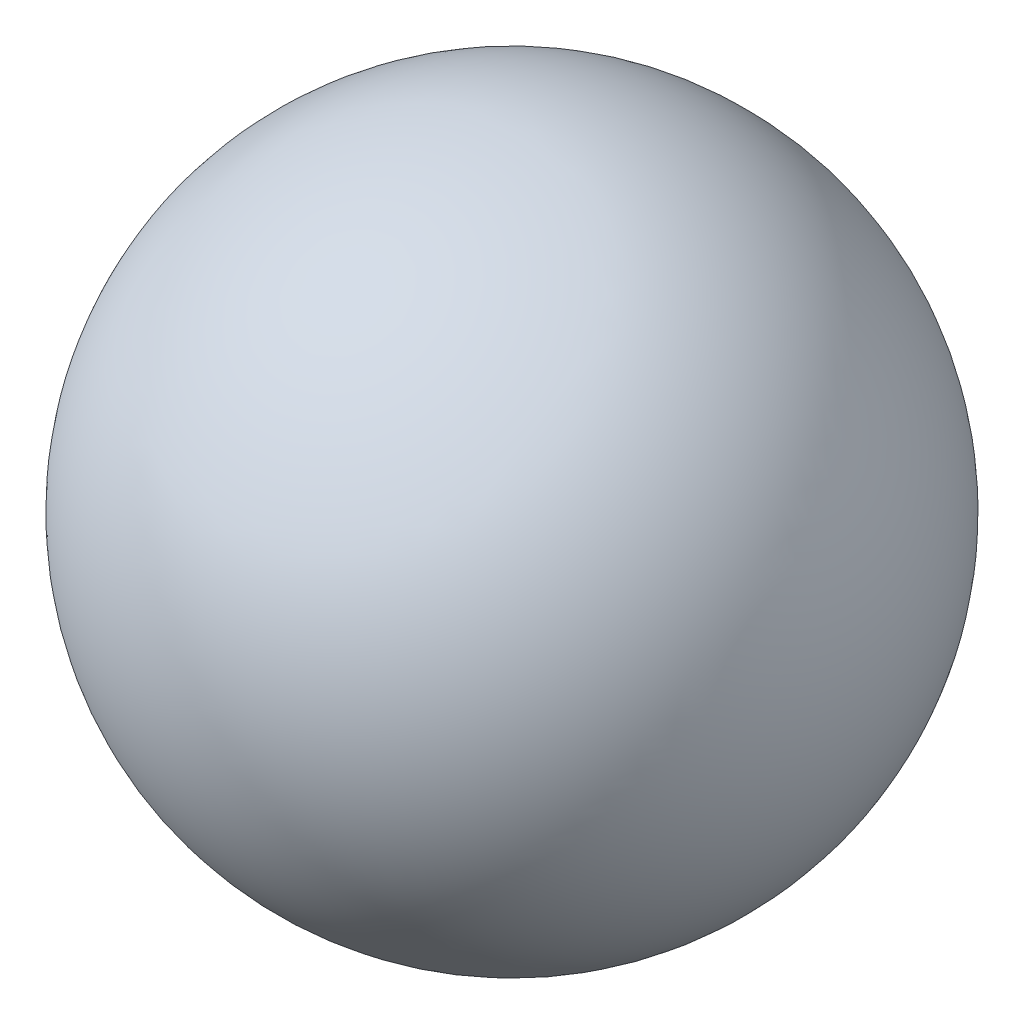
from build123d import *


with BuildPart() as part:
    # Esquisse1 → Base-R_volution (revolve)
    with BuildSketch(Plane.XY):
        with BuildLine():
            Line((-3.55, 0), (3.55, 0))
            ThreePointArc((3.55, 0), (0, 3.55), (-3.55, 0))
        make_face()
    revolve(axis=Axis((-6.085721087, 0, 0), (1, 0, 0)))


solid = part.part
